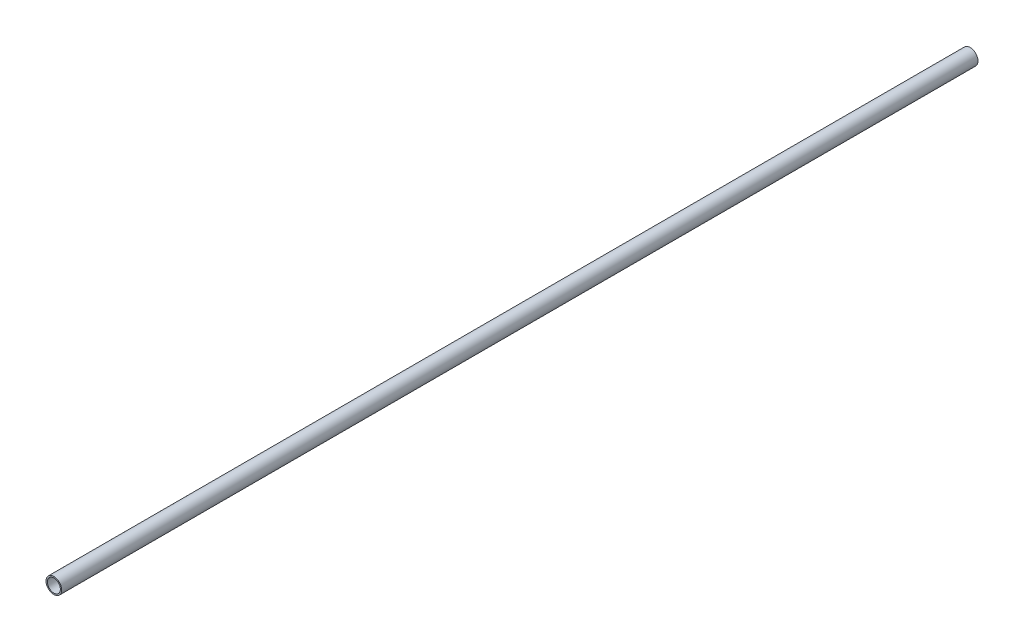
from build123d import *

# Parameters (mm, degrees)
SKETCH1_R      = 18
SKETCH1_R_2    = 15
EXTRUDE1_DEPTH = 2100


with BuildPart() as part:
    # Sketch1 → Extrude1 (new body)
    with BuildSketch(Plane.XY):
        Circle(SKETCH1_R)
        Circle(SKETCH1_R_2, mode=Mode.SUBTRACT)
    extrude(amount=EXTRUDE1_DEPTH)


solid = part.part
